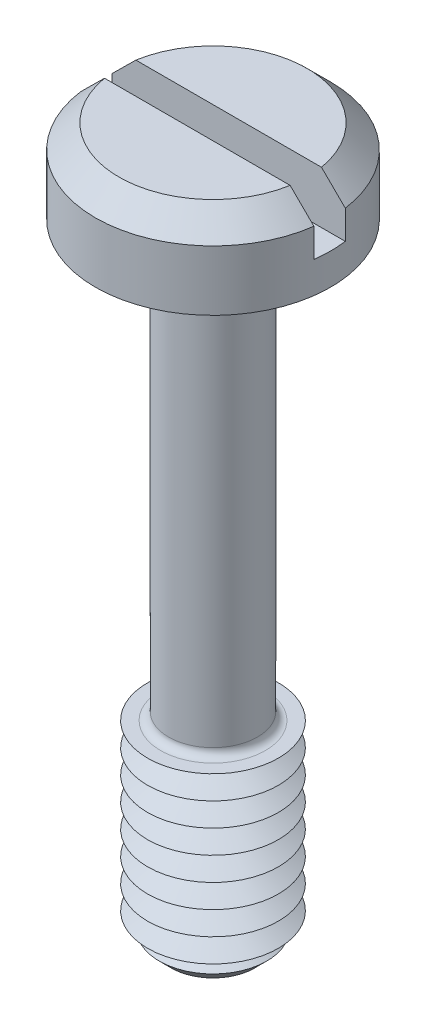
from build123d import *

# Parameters (mm, degrees)
SKETCH1_R           = 2.25
BOSS_EXTRUDE1_DEPTH = 1.6
SKETCH2_R           = 0.85
BOSS_EXTRUDE2_DEPTH = 12
SKETCH3_R           = 1.25
BOSS_EXTRUDE3_DEPTH = 3.7
CHAMFER1_SIZE       = 0.45
LPATTERN1_COUNT     = 8
LPATTERN1_PITCH     = 0.45
FILLET1_R           = 0.15
CHAMFER2_SIZE       = 0.45
SKETCH6_W           = 4.5
SKETCH6_H           = 0.6
CUT_EXTRUDE1_DEPTH  = 1


with BuildPart() as part:
    # Sketch1 → Boss-Extrude1 (new body)
    with BuildSketch(Plane(origin=(0, 0, 0), x_dir=(1, 0, 0), z_dir=(0, 1, 0))):
        with Locations(Location((0, 0, 0), (0, 0, 270))):
            Circle(SKETCH1_R)
    extrude(amount=BOSS_EXTRUDE1_DEPTH)

    # Sketch2 → Boss-Extrude2 (add)
    with BuildSketch(Plane.XZ):
        with Locations(Location((0, 0, 0), (0, 0, 270))):
            Circle(SKETCH2_R)
    extrude(amount=BOSS_EXTRUDE2_DEPTH)

    # Sketch3 → Boss-Extrude3 (add)
    with BuildSketch(Plane.XZ.offset(12)):
        with Locations(Location((0, 0, 0), (0, 0, 270))):
            Circle(SKETCH3_R)
    extrude(amount=-BOSS_EXTRUDE3_DEPTH)

    # Chamfer1
    chamfer1_edges = [part.edges().sort_by_distance(p)[0] for p in [
        (0, -12, 1.25),
    ]]
    chamfer(chamfer1_edges, length=CHAMFER1_SIZE)

    # Sketch5 → Cut-Revolve1 (revolve, cut)
    with BuildSketch(Plane(origin=(0, 0, 0), x_dir=(0, 0, -1), z_dir=(1, 0, 0))):
        Polygon((-1.25, -8.3), (-0.860288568, -8.525), (-1.25, -8.75), align=None)
    cut_revolve1 = revolve(axis=Axis((0, -6.58711856, 0), (0, -1, 0)), mode=Mode.SUBTRACT)

    # LPattern1: Cut-Revolve1 ×8
    with Locations(*[(0, -i * LPATTERN1_PITCH, 0) for i in range(1, LPATTERN1_COUNT)]):
        add(cut_revolve1, mode=Mode.SUBTRACT)

    # Fillet1
    fillet1_edges = [part.edges().sort_by_distance(p)[0] for p in [
        (0, 0, 0.85),
        (0, -8.3, 0.85),
    ]]
    fillet(fillet1_edges, radius=FILLET1_R)

    # Chamfer2
    chamfer2_edges = [part.edges().sort_by_distance(p)[0] for p in [
        (0, 1.6, -2.25),
    ]]
    chamfer(chamfer2_edges, length=CHAMFER2_SIZE)

    # Sketch6 → Cut-Extrude1 (cut)
    with BuildSketch(Plane(origin=(0, 1.6, 0), x_dir=(1, 0, 0), z_dir=(0, 1, 0))):
        Rectangle(SKETCH6_W, SKETCH6_H)
    extrude(amount=-CUT_EXTRUDE1_DEPTH, mode=Mode.SUBTRACT)


solid = part.part
